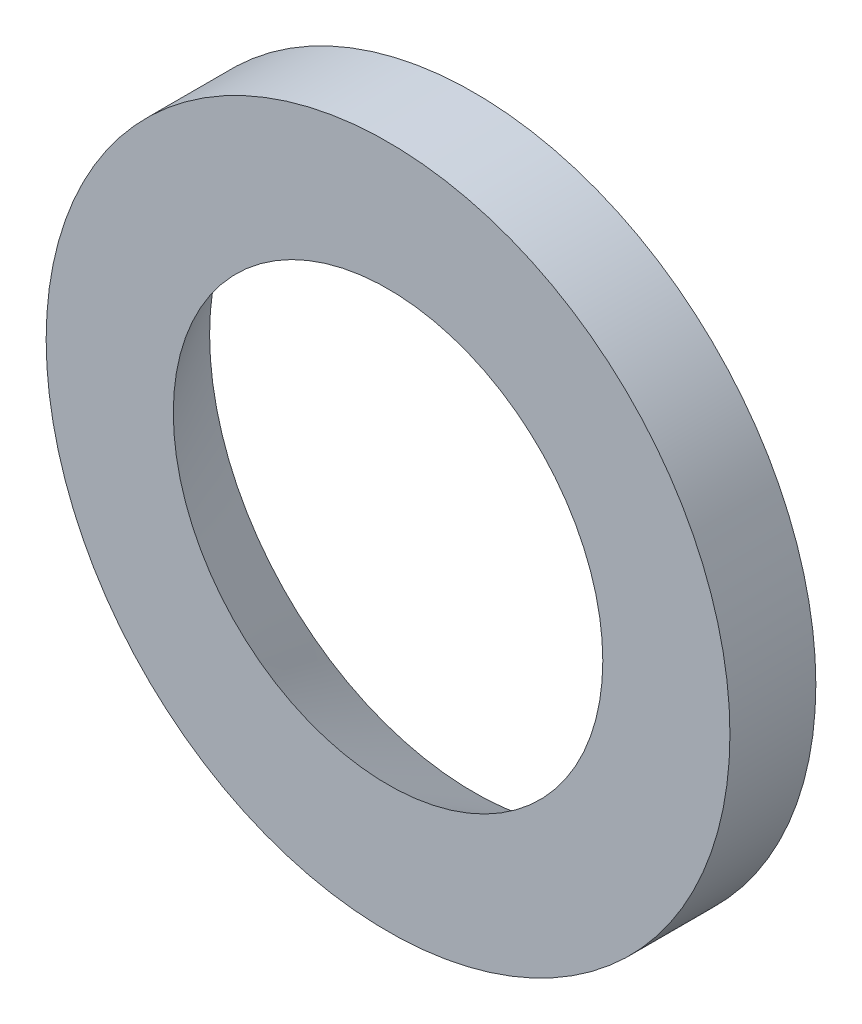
ISO-10303-21;
HEADER;
FILE_DESCRIPTION(('STEP AP214'),'2;1');
FILE_NAME('part.step','',(''),(''),'','','');
FILE_SCHEMA(('AUTOMOTIVE_DESIGN { 1 0 10303 214 1 1 1 1 }'));
ENDSEC;
DATA;
#1=APPLICATION_CONTEXT('core data for automotive mechanical design processes');
#2=APPLICATION_PROTOCOL_DEFINITION('international standard','automotive_design',2000,#1);
#3=PRODUCT_CONTEXT('',#1,'mechanical');
#4=PRODUCT('Part','Part','',(#3));
#5=PRODUCT_RELATED_PRODUCT_CATEGORY('part','',(#4));
#6=PRODUCT_DEFINITION_FORMATION('','',#4);
#7=PRODUCT_DEFINITION_CONTEXT('part definition',#1,'design');
#8=PRODUCT_DEFINITION('design','',#6,#7);
#9=PRODUCT_DEFINITION_SHAPE('','',#8);
#10=(LENGTH_UNIT() NAMED_UNIT(*) SI_UNIT(.MILLI.,.METRE.));
#11=(NAMED_UNIT(*) PLANE_ANGLE_UNIT() SI_UNIT($,.RADIAN.));
#12=(NAMED_UNIT(*) SI_UNIT($,.STERADIAN.) SOLID_ANGLE_UNIT());
#13=UNCERTAINTY_MEASURE_WITH_UNIT(LENGTH_MEASURE(1.E-05),#10,'distance_accuracy_value','');
#14=(GEOMETRIC_REPRESENTATION_CONTEXT(3) GLOBAL_UNCERTAINTY_ASSIGNED_CONTEXT((#13)) GLOBAL_UNIT_ASSIGNED_CONTEXT((#10,
#11,#12)) REPRESENTATION_CONTEXT('',''));
#15=CARTESIAN_POINT('',(0.,0.,0.));
#16=DIRECTION('',(0.,0.,1.));
#17=DIRECTION('',(1.,0.,0.));
#18=AXIS2_PLACEMENT_3D('',#15,#16,#17);
#19=CARTESIAN_POINT('',(0.,0.,0.));
#20=DIRECTION('',(0.,0.,1.));
#21=DIRECTION('',(1.,0.,0.));
#22=AXIS2_PLACEMENT_3D('',#19,#20,#21);
#23=CYLINDRICAL_SURFACE('',#22,19.9);
#24=CARTESIAN_POINT('',(0.,0.,0.));
#25=DIRECTION('',(0.,0.,1.));
#26=DIRECTION('',(1.,0.,0.));
#27=AXIS2_PLACEMENT_3D('',#24,#25,#26);
#28=CIRCLE('',#27,19.9);
#29=CARTESIAN_POINT('',(19.9,0.,0.));
#30=VERTEX_POINT('',#29);
#31=EDGE_CURVE('E11',#30,#30,#28,.T.);
#32=ORIENTED_EDGE('',*,*,#31,.F.);
#33=EDGE_LOOP('',(#32));
#34=FACE_BOUND('',#33,.T.);
#35=CARTESIAN_POINT('',(0.,0.,-5.));
#36=DIRECTION('',(0.,0.,-1.));
#37=DIRECTION('',(-1.,0.,0.));
#38=AXIS2_PLACEMENT_3D('',#35,#36,#37);
#39=CIRCLE('',#38,19.9);
#40=CARTESIAN_POINT('',(-19.9,0.,-5.));
#41=VERTEX_POINT('',#40);
#42=EDGE_CURVE('E47',#41,#41,#39,.T.);
#43=ORIENTED_EDGE('',*,*,#42,.F.);
#44=EDGE_LOOP('',(#43));
#45=FACE_BOUND('',#44,.T.);
#46=ADVANCED_FACE('F33',(#34,#45),#23,.T.);
#47=CARTESIAN_POINT('',(0.,19.9,0.));
#48=DIRECTION('',(0.,0.,-1.));
#49=DIRECTION('',(-1.,0.,0.));
#50=AXIS2_PLACEMENT_3D('',#47,#48,#49);
#51=PLANE('',#50);
#52=CARTESIAN_POINT('',(0.,0.,0.));
#53=DIRECTION('',(0.,0.,1.));
#54=DIRECTION('',(1.,0.,0.));
#55=AXIS2_PLACEMENT_3D('',#52,#53,#54);
#56=CIRCLE('',#55,12.5);
#57=CARTESIAN_POINT('',(12.5,0.,0.));
#58=VERTEX_POINT('',#57);
#59=EDGE_CURVE('E41',#58,#58,#56,.T.);
#60=ORIENTED_EDGE('',*,*,#59,.F.);
#61=EDGE_LOOP('',(#60));
#62=FACE_BOUND('',#61,.T.);
#63=ORIENTED_EDGE('',*,*,#31,.T.);
#64=EDGE_LOOP('',(#63));
#65=FACE_BOUND('',#64,.T.);
#66=ADVANCED_FACE('F58',(#62,#65),#51,.F.);
#67=CARTESIAN_POINT('',(0.,0.,0.));
#68=DIRECTION('',(0.,0.,-1.));
#69=DIRECTION('',(-1.,0.,0.));
#70=AXIS2_PLACEMENT_3D('',#67,#68,#69);
#71=CONICAL_SURFACE('',#70,12.5,0.523598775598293);
#72=CARTESIAN_POINT('',(0.,0.,-5.));
#73=DIRECTION('',(0.,0.,-1.));
#74=DIRECTION('',(-1.,0.,0.));
#75=AXIS2_PLACEMENT_3D('',#72,#73,#74);
#76=CIRCLE('',#75,15.3867513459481);
#77=CARTESIAN_POINT('',(-15.3867513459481,0.,-5.));
#78=VERTEX_POINT('',#77);
#79=EDGE_CURVE('E37',#78,#78,#76,.F.);
#80=ORIENTED_EDGE('',*,*,#79,.F.);
#81=EDGE_LOOP('',(#80));
#82=FACE_BOUND('',#81,.T.);
#83=ORIENTED_EDGE('',*,*,#59,.T.);
#84=EDGE_LOOP('',(#83));
#85=FACE_BOUND('',#84,.T.);
#86=ADVANCED_FACE('F55',(#82,#85),#71,.F.);
#87=CARTESIAN_POINT('',(0.,0.,-5.));
#88=DIRECTION('',(0.,0.,-1.));
#89=DIRECTION('',(-1.,0.,0.));
#90=AXIS2_PLACEMENT_3D('',#87,#88,#89);
#91=PLANE('',#90);
#92=ORIENTED_EDGE('',*,*,#42,.T.);
#93=EDGE_LOOP('',(#92));
#94=FACE_BOUND('',#93,.T.);
#95=ORIENTED_EDGE('',*,*,#79,.T.);
#96=EDGE_LOOP('',(#95));
#97=FACE_BOUND('',#96,.T.);
#98=ADVANCED_FACE('F35',(#94,#97),#91,.T.);
#99=CLOSED_SHELL('',(#46,#66,#86,#98));
#100=MANIFOLD_SOLID_BREP('B2',#99);
#101=ADVANCED_BREP_SHAPE_REPRESENTATION('',(#18,#100),#14);
#102=SHAPE_DEFINITION_REPRESENTATION(#9,#101);
ENDSEC;
END-ISO-10303-21;
